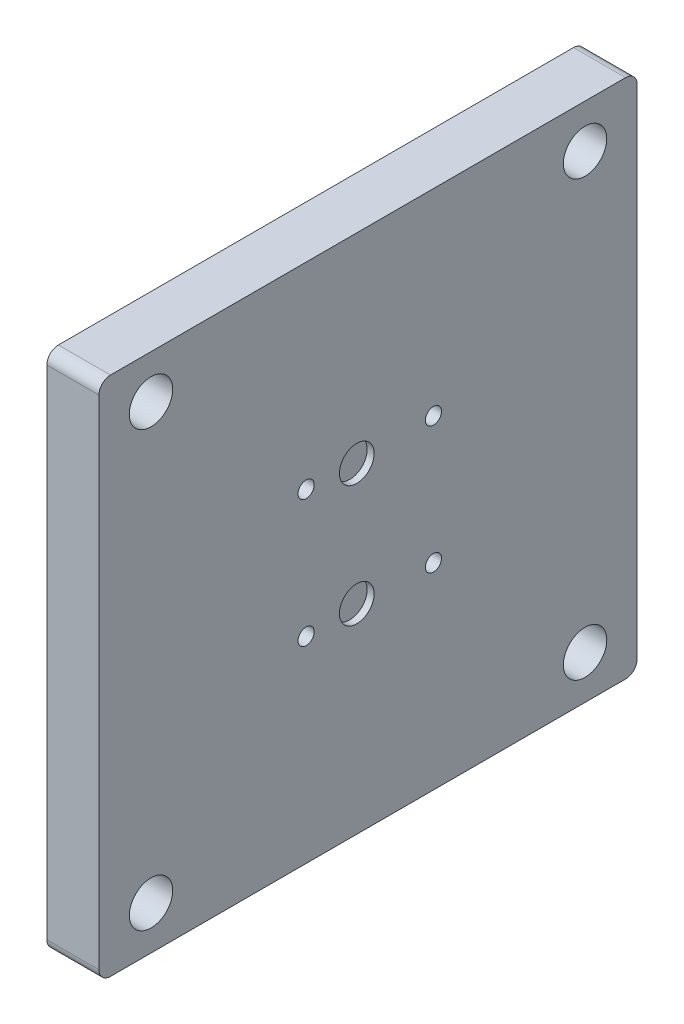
from build123d import *

# Parameters (mm, degrees)
SKETCH_1_W                = 93
SKETCH_1_H                = 90
EXTRUDE_1_DEPTH           = 9
CUT_EXTRUDE_1_DEPTH       = 2.75
FILLET_1_R                = 2
HOLE_WIZARD_1_D           = 3.3
HOLE_WIZARD_1_DEPTH       = 10.1
HOLE_WIZARD_1_CBORE_D     = 7.5
HOLE_WIZARD_1_CBORE_DEPTH = 6
HOLE_WIZARD_1_TIP         = 0.991420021
SKETCH_16_R               = 2.5
CUT_EXTRUDE_2_DEPTH       = 2.75
EXTRUDE_START             = 2.75
EXTRUDE_2_DEPTH           = 2.75
SKETCH_24_R               = 3
CUT_EXTRUDE_3_DEPTH       = 1.2
HOLE_WIZARD_2_D           = 2.8
HOLE_WIZARD_2_DEPTH       = 15
HOLE_WIZARD_2_CBORE_D     = 6.5
HOLE_WIZARD_2_CBORE_DEPTH = 6
HOLE_WIZARD_2_TIP         = 0.841204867


with BuildPart() as part:
    # Sketch 1 → Extrude 1 (new body)
    with BuildSketch(Plane(origin=(0, 0, 0), x_dir=(0, 0, -1), z_dir=(1, 0, 0))):
        Rectangle(SKETCH_1_W, SKETCH_1_H)
    extrude(amount=EXTRUDE_1_DEPTH)

    # Sketch 2 → Cut-Extrude 1 (cut)
    with BuildSketch(Plane.ZY):
        Polygon((-26.5, -26.5), (26.5, -26.5), (46.5, -26.5), (46.5, -21.5), (26.5, -21.5), (26.5, 21.5), (46.5, 21.5), (46.5, 26.5), (26.5, 26.5), (-26.5, 26.5), align=None)
    extrude(amount=-CUT_EXTRUDE_1_DEPTH, mode=Mode.SUBTRACT)

    # Fillet 1
    fillet_1_edges = [part.edges().sort_by_distance(p)[0] for p in [
        (4.5, -45, -46.5),
        (4.5, -45, 46.5),
        (4.5, 45, 46.5),
        (4.5, 45, -46.5),
    ]]
    fillet(fillet_1_edges, radius=FILLET_1_R)

    # Hole Wizard 1
    with Locations(Plane(origin=(9, 0, 0), x_dir=(0, 0, -1), z_dir=(1, 0, 0))):
        with Locations((-37.5, 37.5), (37.5, 37.5), (-37.5, -37.5), (37.5, -37.5)):
            CounterBoreHole(HOLE_WIZARD_1_D / 2, HOLE_WIZARD_1_CBORE_D / 2, HOLE_WIZARD_1_CBORE_DEPTH, depth=HOLE_WIZARD_1_DEPTH)
            with Locations((0, 0, -(HOLE_WIZARD_1_DEPTH + HOLE_WIZARD_1_TIP / 2))):  # 118° drill point
                Cone(0, HOLE_WIZARD_1_D / 2, HOLE_WIZARD_1_TIP, mode=Mode.SUBTRACT)

    # Sketch 16 → Cut-Extrude 2 (cut)
    with BuildSketch(Plane.ZY):
        with Locations((-26.5, 26.5)):
            Circle(SKETCH_16_R)
        with Locations((-26.5, -26.5)):
            Circle(SKETCH_16_R)
    extrude(amount=-CUT_EXTRUDE_2_DEPTH, mode=Mode.SUBTRACT)

    # Sketch 19 → Extrude 2 (add)
    with BuildSketch(Plane.ZY.offset(-2.75).offset(EXTRUDE_START)):
        with BuildLine():
            Line((-26.5, 24), (-26.5, -24))
            ThreePointArc((-26.5, -24), (-28.267766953, -28.267766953), (-24, -26.5))
            Line((-24, -26.5), (46.5, -26.5))
            Line((46.5, -26.5), (46.5, -21.5))
            Line((46.5, -21.5), (26.5, -21.5))
            Line((26.5, -21.5), (26.5, 21.5))
            Line((26.5, 21.5), (46.5, 21.5))
            Line((46.5, 21.5), (46.5, 26.5))
            Line((46.5, 26.5), (-24, 26.5))
            ThreePointArc((-24, 26.5), (-28.267766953, 28.267766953), (-26.5, 24))
        make_face()
    extrude(amount=-EXTRUDE_2_DEPTH)

    # Sketch 24 → Cut-Extrude 3 (cut)
    with BuildSketch(Plane(origin=(9, 0, 0), x_dir=(0, 0, -1), z_dir=(1, 0, 0))):
        with Locations((-1.95, 10.5)):
            Circle(SKETCH_24_R)
        with Locations((-1.95, -10.5)):
            Circle(SKETCH_24_R)
    extrude(amount=-CUT_EXTRUDE_3_DEPTH, mode=Mode.SUBTRACT)

    # Hole Wizard 2
    with Locations(Plane.ZY):
        with Locations((-11.3, -11), (-11.3, 11), (10.7, -11), (10.7, 11)):
            CounterBoreHole(HOLE_WIZARD_2_D / 2, HOLE_WIZARD_2_CBORE_D / 2, HOLE_WIZARD_2_CBORE_DEPTH, depth=HOLE_WIZARD_2_DEPTH)
            with Locations((0, 0, -(HOLE_WIZARD_2_DEPTH + HOLE_WIZARD_2_TIP / 2))):  # 118° drill point
                Cone(0, HOLE_WIZARD_2_D / 2, HOLE_WIZARD_2_TIP, mode=Mode.SUBTRACT)


solid = part.part
